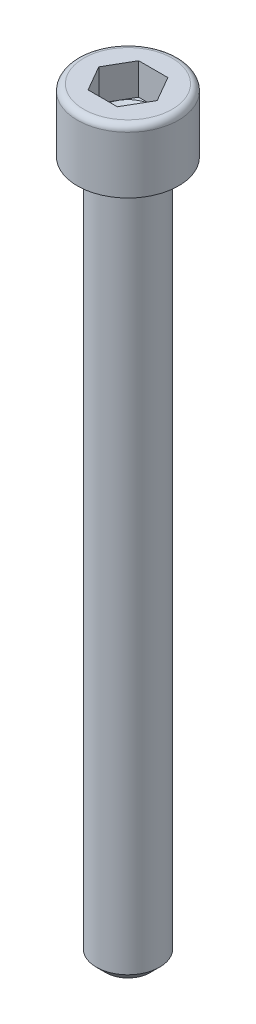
from build123d import *

# Parameters (mm, degrees)
TIGE_START              = -110
ESQUISSE1_R             = 5
TIGE_DEPTH              = 110
CHANFREIN_D_ENTR_E_SIZE = 1.5
HEXAGONE_DEPTH          = 5


with BuildPart() as part:
    # Esquisse1 → Tige (new body)
    with BuildSketch(Plane(origin=(0, 0, 0), x_dir=(1, 0, 0), z_dir=(0, 1, 0)).offset(TIGE_START)):
        with Locations(Location((0, 0, 0), (0, 0, 270))):
            Circle(ESQUISSE1_R)
    extrude(amount=TIGE_DEPTH)

    # Chanfrein d_entr_e
    chanfrein_d_entr_e_edges = [part.edges().sort_by_distance(p)[0] for p in [
        (0, -110, -5),
    ]]
    chamfer(chanfrein_d_entr_e_edges, length=CHANFREIN_D_ENTR_E_SIZE)

    # Esquisse2 → T_te (revolve)
    with BuildSketch(Plane.XY, mode=Mode.PRIVATE) as t_te_sk:
        with BuildLine():
            Line((4, 10), (4, 5))
            Line((4, 5), (0, 2.690598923))
            Line((0, 2.690598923), (0, 0))
            Line((0, 0), (8, 0))
            Line((8, 0), (8, 9))
            ThreePointArc((8, 9), (7.707106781, 9.707106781), (7, 10))
            Line((7, 10), (4, 10))
        make_face()
    revolve(t_te_sk.sketch.rotate(Axis((0, 10, 0), (0, -1, 0)), 180), axis=Axis((0, 10, 0), (0, -1, 0)))

    # Esquisse3 → Hexagone (cut)
    with BuildSketch(Plane(origin=(0, 10, -3), x_dir=(1, 0, 0), z_dir=(0, -1, 0))):
        Polygon((2.309401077, 7), (-2.309401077, 7), (-4.618802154, 3), (-2.309401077, -1), (2.309401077, -1), (4.618802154, 3), align=None)
    extrude(amount=HEXAGONE_DEPTH, mode=Mode.SUBTRACT)


solid = part.part
